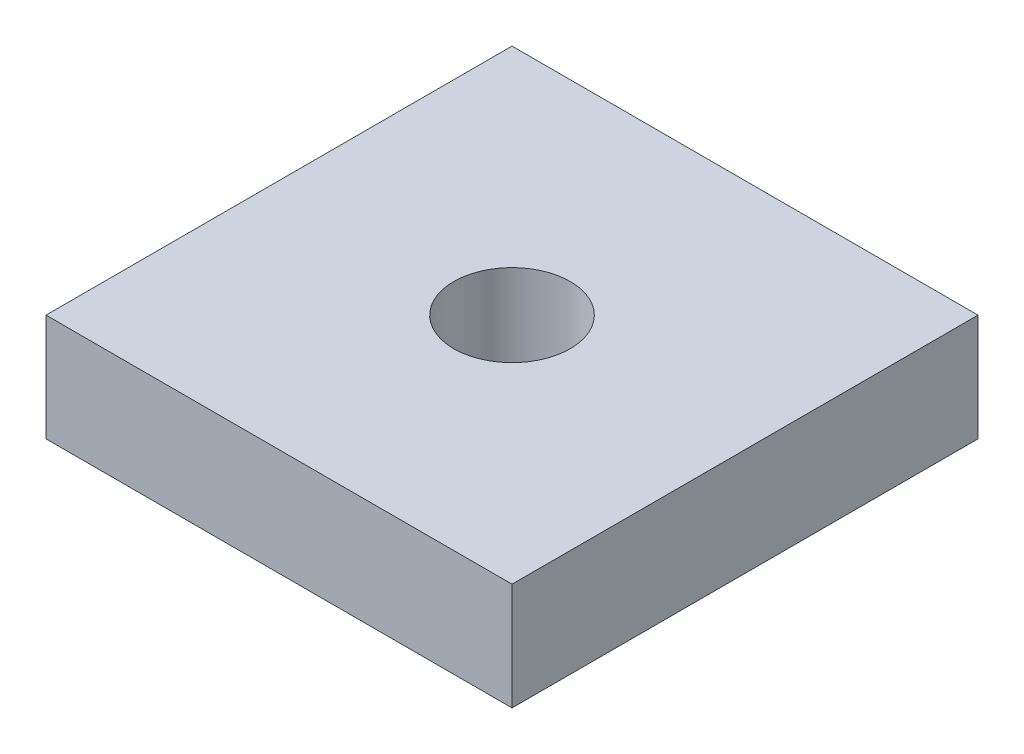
from build123d import *

# Parameters (mm, degrees)
SKETCH1_W           = 38.1
SKETCH1_H           = 38.1
SKETCH1_R           = 4.7625
BOSS_EXTRUDE1_DEPTH = 8.763


with BuildPart() as part:
    # Sketch1 → Boss-Extrude1 (new body)
    with BuildSketch(Plane(origin=(0, 0, 0), x_dir=(1, 0, 0), z_dir=(0, 1, 0))):
        with Locations((19.05, 19.05)):
            Rectangle(SKETCH1_W, SKETCH1_H)
        with Locations(Location((19.05, 19.05, 0), (0, 0, 270))):
            Circle(SKETCH1_R, mode=Mode.SUBTRACT)
    extrude(amount=BOSS_EXTRUDE1_DEPTH)


solid = part.part
